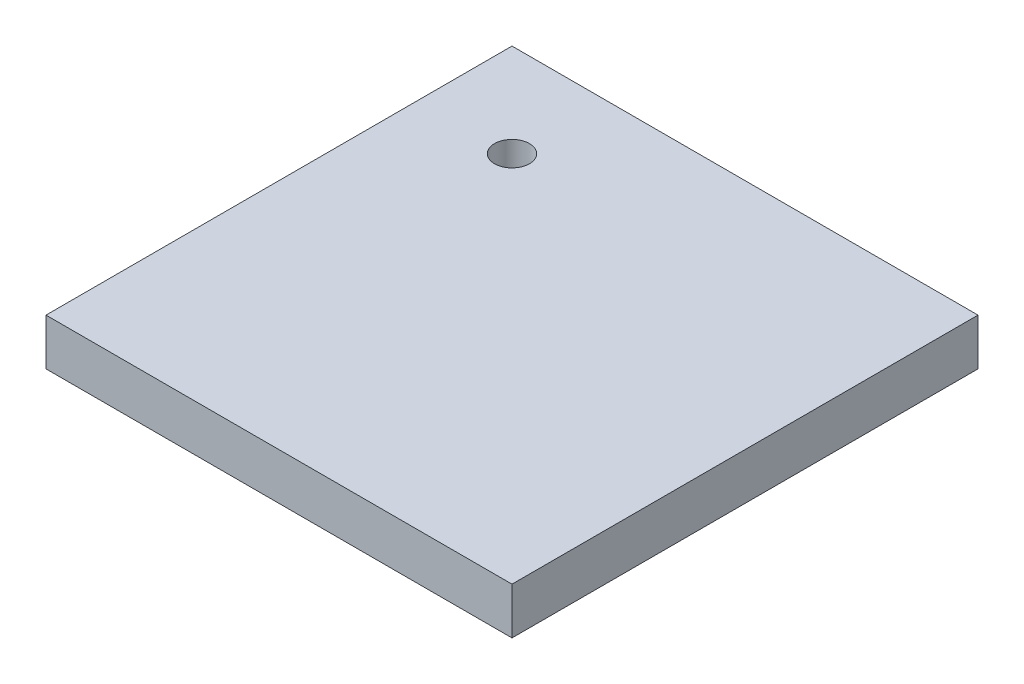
ISO-10303-21;
HEADER;
FILE_DESCRIPTION(('STEP AP214'),'2;1');
FILE_NAME('part.step','',(''),(''),'','','');
FILE_SCHEMA(('AUTOMOTIVE_DESIGN { 1 0 10303 214 1 1 1 1 }'));
ENDSEC;
DATA;
#1=APPLICATION_CONTEXT('core data for automotive mechanical design processes');
#2=APPLICATION_PROTOCOL_DEFINITION('international standard','automotive_design',2000,#1);
#3=PRODUCT_CONTEXT('',#1,'mechanical');
#4=PRODUCT('Part','Part','',(#3));
#5=PRODUCT_RELATED_PRODUCT_CATEGORY('part','',(#4));
#6=PRODUCT_DEFINITION_FORMATION('','',#4);
#7=PRODUCT_DEFINITION_CONTEXT('part definition',#1,'design');
#8=PRODUCT_DEFINITION('design','',#6,#7);
#9=PRODUCT_DEFINITION_SHAPE('','',#8);
#10=(LENGTH_UNIT() NAMED_UNIT(*) SI_UNIT(.MILLI.,.METRE.));
#11=(NAMED_UNIT(*) PLANE_ANGLE_UNIT() SI_UNIT($,.RADIAN.));
#12=(NAMED_UNIT(*) SI_UNIT($,.STERADIAN.) SOLID_ANGLE_UNIT());
#13=UNCERTAINTY_MEASURE_WITH_UNIT(LENGTH_MEASURE(1.E-05),#10,'distance_accuracy_value','');
#14=(GEOMETRIC_REPRESENTATION_CONTEXT(3) GLOBAL_UNCERTAINTY_ASSIGNED_CONTEXT((#13)) GLOBAL_UNIT_ASSIGNED_CONTEXT((#10,
#11,#12)) REPRESENTATION_CONTEXT('',''));
#15=CARTESIAN_POINT('',(0.,0.,0.));
#16=DIRECTION('',(0.,0.,1.));
#17=DIRECTION('',(1.,0.,0.));
#18=AXIS2_PLACEMENT_3D('',#15,#16,#17);
#19=CARTESIAN_POINT('',(0.,10.,0.));
#20=DIRECTION('',(1.,0.,0.));
#21=DIRECTION('',(0.,0.,-1.));
#22=AXIS2_PLACEMENT_3D('',#19,#20,#21);
#23=PLANE('',#22);
#24=DIRECTION('',(0.,0.,1.));
#25=VECTOR('',#24,1.);
#26=CARTESIAN_POINT('',(0.,0.,0.));
#27=LINE('',#26,#25);
#28=CARTESIAN_POINT('',(0.,0.,-100.));
#29=VERTEX_POINT('',#28);
#30=CARTESIAN_POINT('',(0.,0.,0.));
#31=VERTEX_POINT('',#30);
#32=EDGE_CURVE('E95',#29,#31,#27,.T.);
#33=ORIENTED_EDGE('',*,*,#32,.T.);
#34=DIRECTION('',(0.,-1.,0.));
#35=VECTOR('',#34,1.);
#36=CARTESIAN_POINT('',(0.,10.,0.));
#37=LINE('',#36,#35);
#38=CARTESIAN_POINT('',(0.,10.,0.));
#39=VERTEX_POINT('',#38);
#40=EDGE_CURVE('E11',#39,#31,#37,.T.);
#41=ORIENTED_EDGE('',*,*,#40,.F.);
#42=DIRECTION('',(0.,0.,1.));
#43=VECTOR('',#42,1.);
#44=CARTESIAN_POINT('',(0.,10.,0.));
#45=LINE('',#44,#43);
#46=CARTESIAN_POINT('',(0.,10.,-100.));
#47=VERTEX_POINT('',#46);
#48=EDGE_CURVE('E83',#47,#39,#45,.T.);
#49=ORIENTED_EDGE('',*,*,#48,.F.);
#50=DIRECTION('',(0.,-1.,0.));
#51=VECTOR('',#50,1.);
#52=CARTESIAN_POINT('',(0.,10.,-100.));
#53=LINE('',#52,#51);
#54=EDGE_CURVE('E91',#47,#29,#53,.T.);
#55=ORIENTED_EDGE('',*,*,#54,.T.);
#56=EDGE_LOOP('',(#33,#41,#49,#55));
#57=FACE_BOUND('',#56,.T.);
#58=ADVANCED_FACE('F32',(#57),#23,.F.);
#59=CARTESIAN_POINT('',(0.,10.,0.));
#60=DIRECTION('',(0.,0.,-1.));
#61=DIRECTION('',(-1.,0.,0.));
#62=AXIS2_PLACEMENT_3D('',#59,#60,#61);
#63=PLANE('',#62);
#64=DIRECTION('',(1.,0.,0.));
#65=VECTOR('',#64,1.);
#66=CARTESIAN_POINT('',(0.,0.,0.));
#67=LINE('',#66,#65);
#68=CARTESIAN_POINT('',(100.,0.,0.));
#69=VERTEX_POINT('',#68);
#70=EDGE_CURVE('E87',#31,#69,#67,.T.);
#71=ORIENTED_EDGE('',*,*,#70,.T.);
#72=DIRECTION('',(0.,-1.,0.));
#73=VECTOR('',#72,1.);
#74=CARTESIAN_POINT('',(100.,10.,0.));
#75=LINE('',#74,#73);
#76=CARTESIAN_POINT('',(100.,10.,0.));
#77=VERTEX_POINT('',#76);
#78=EDGE_CURVE('E40',#77,#69,#75,.T.);
#79=ORIENTED_EDGE('',*,*,#78,.F.);
#80=DIRECTION('',(1.,0.,0.));
#81=VECTOR('',#80,1.);
#82=CARTESIAN_POINT('',(0.,10.,0.));
#83=LINE('',#82,#81);
#84=EDGE_CURVE('E78',#39,#77,#83,.T.);
#85=ORIENTED_EDGE('',*,*,#84,.F.);
#86=ORIENTED_EDGE('',*,*,#40,.T.);
#87=EDGE_LOOP('',(#71,#79,#85,#86));
#88=FACE_BOUND('',#87,.T.);
#89=ADVANCED_FACE('F86',(#88),#63,.F.);
#90=CARTESIAN_POINT('',(100.,10.,0.));
#91=DIRECTION('',(-1.,0.,0.));
#92=DIRECTION('',(0.,0.,1.));
#93=AXIS2_PLACEMENT_3D('',#90,#91,#92);
#94=PLANE('',#93);
#95=DIRECTION('',(0.,0.,-1.));
#96=VECTOR('',#95,1.);
#97=CARTESIAN_POINT('',(100.,0.,0.));
#98=LINE('',#97,#96);
#99=CARTESIAN_POINT('',(100.,0.,-100.));
#100=VERTEX_POINT('',#99);
#101=EDGE_CURVE('E65',#69,#100,#98,.T.);
#102=ORIENTED_EDGE('',*,*,#101,.T.);
#103=DIRECTION('',(0.,-1.,0.));
#104=VECTOR('',#103,1.);
#105=CARTESIAN_POINT('',(100.,10.,-100.));
#106=LINE('',#105,#104);
#107=CARTESIAN_POINT('',(100.,10.,-100.));
#108=VERTEX_POINT('',#107);
#109=EDGE_CURVE('E88',#108,#100,#106,.T.);
#110=ORIENTED_EDGE('',*,*,#109,.F.);
#111=DIRECTION('',(0.,0.,-1.));
#112=VECTOR('',#111,1.);
#113=CARTESIAN_POINT('',(100.,10.,0.));
#114=LINE('',#113,#112);
#115=EDGE_CURVE('E81',#77,#108,#114,.T.);
#116=ORIENTED_EDGE('',*,*,#115,.F.);
#117=ORIENTED_EDGE('',*,*,#78,.T.);
#118=EDGE_LOOP('',(#102,#110,#116,#117));
#119=FACE_BOUND('',#118,.T.);
#120=ADVANCED_FACE('F89',(#119),#94,.F.);
#121=CARTESIAN_POINT('',(0.,10.,-100.));
#122=DIRECTION('',(0.,0.,1.));
#123=DIRECTION('',(1.,0.,0.));
#124=AXIS2_PLACEMENT_3D('',#121,#122,#123);
#125=PLANE('',#124);
#126=DIRECTION('',(-1.,0.,0.));
#127=VECTOR('',#126,1.);
#128=CARTESIAN_POINT('',(0.,0.,-100.));
#129=LINE('',#128,#127);
#130=EDGE_CURVE('E71',#100,#29,#129,.T.);
#131=ORIENTED_EDGE('',*,*,#130,.T.);
#132=ORIENTED_EDGE('',*,*,#54,.F.);
#133=DIRECTION('',(-1.,0.,0.));
#134=VECTOR('',#133,1.);
#135=CARTESIAN_POINT('',(0.,10.,-100.));
#136=LINE('',#135,#134);
#137=EDGE_CURVE('E48',#108,#47,#136,.T.);
#138=ORIENTED_EDGE('',*,*,#137,.F.);
#139=ORIENTED_EDGE('',*,*,#109,.T.);
#140=EDGE_LOOP('',(#131,#132,#138,#139));
#141=FACE_BOUND('',#140,.T.);
#142=ADVANCED_FACE('F103',(#141),#125,.F.);
#143=CARTESIAN_POINT('',(0.,10.,-100.));
#144=DIRECTION('',(0.,-1.,0.));
#145=DIRECTION('',(0.,0.,-1.));
#146=AXIS2_PLACEMENT_3D('',#143,#144,#145);
#147=PLANE('',#146);
#148=CARTESIAN_POINT('',(20.,10.,-80.));
#149=DIRECTION('',(0.,1.,0.));
#150=DIRECTION('',(0.,0.,1.));
#151=AXIS2_PLACEMENT_3D('',#148,#149,#150);
#152=CIRCLE('',#151,3.75);
#153=CARTESIAN_POINT('',(20.,10.,-76.25));
#154=VERTEX_POINT('',#153);
#155=EDGE_CURVE('E111',#154,#154,#152,.T.);
#156=ORIENTED_EDGE('',*,*,#155,.F.);
#157=EDGE_LOOP('',(#156));
#158=FACE_BOUND('',#157,.T.);
#159=ORIENTED_EDGE('',*,*,#48,.T.);
#160=ORIENTED_EDGE('',*,*,#84,.T.);
#161=ORIENTED_EDGE('',*,*,#115,.T.);
#162=ORIENTED_EDGE('',*,*,#137,.T.);
#163=EDGE_LOOP('',(#159,#160,#161,#162));
#164=FACE_BOUND('',#163,.T.);
#165=ADVANCED_FACE('F79',(#158,#164),#147,.F.);
#166=CARTESIAN_POINT('',(0.,0.,-100.));
#167=DIRECTION('',(0.,-1.,0.));
#168=DIRECTION('',(0.,0.,-1.));
#169=AXIS2_PLACEMENT_3D('',#166,#167,#168);
#170=PLANE('',#169);
#171=CARTESIAN_POINT('',(20.,0.,-80.));
#172=DIRECTION('',(0.,1.,0.));
#173=DIRECTION('',(0.,0.,1.));
#174=AXIS2_PLACEMENT_3D('',#171,#172,#173);
#175=CIRCLE('',#174,3.75);
#176=CARTESIAN_POINT('',(20.,0.,-76.25));
#177=VERTEX_POINT('',#176);
#178=EDGE_CURVE('E98',#177,#177,#175,.T.);
#179=ORIENTED_EDGE('',*,*,#178,.T.);
#180=EDGE_LOOP('',(#179));
#181=FACE_BOUND('',#180,.T.);
#182=ORIENTED_EDGE('',*,*,#32,.F.);
#183=ORIENTED_EDGE('',*,*,#130,.F.);
#184=ORIENTED_EDGE('',*,*,#101,.F.);
#185=ORIENTED_EDGE('',*,*,#70,.F.);
#186=EDGE_LOOP('',(#182,#183,#184,#185));
#187=FACE_BOUND('',#186,.T.);
#188=ADVANCED_FACE('F106',(#181,#187),#170,.T.);
#189=CARTESIAN_POINT('',(20.,10.,-80.));
#190=DIRECTION('',(0.,1.,0.));
#191=DIRECTION('',(0.,0.,1.));
#192=AXIS2_PLACEMENT_3D('',#189,#190,#191);
#193=CYLINDRICAL_SURFACE('',#192,3.75);
#194=ORIENTED_EDGE('',*,*,#178,.F.);
#195=EDGE_LOOP('',(#194));
#196=FACE_BOUND('',#195,.T.);
#197=ORIENTED_EDGE('',*,*,#155,.T.);
#198=EDGE_LOOP('',(#197));
#199=FACE_BOUND('',#198,.T.);
#200=ADVANCED_FACE('F115',(#196,#199),#193,.F.);
#201=CLOSED_SHELL('',(#58,#89,#120,#142,#165,#188,#200));
#202=MANIFOLD_SOLID_BREP('B2',#201);
#203=ADVANCED_BREP_SHAPE_REPRESENTATION('',(#18,#202),#14);
#204=SHAPE_DEFINITION_REPRESENTATION(#9,#203);
ENDSEC;
END-ISO-10303-21;
